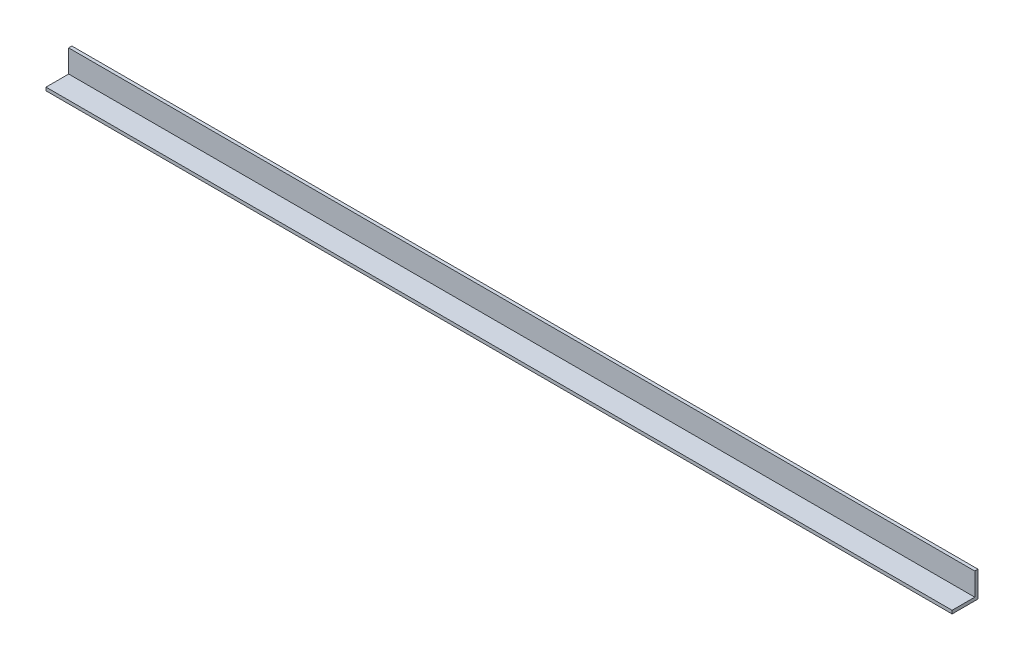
from build123d import *

# Parameters (mm, degrees)
SKETCH1_W           = 889
SKETCH1_H           = 25.4
BOSS_EXTRUDE1_DEPTH = 3.175
SKETCH2_W           = 889
SKETCH2_H           = 3.175
BOSS_EXTRUDE2_DEPTH = 22.225


with BuildPart() as part:
    # Sketch1 → Boss-Extrude1 (new body)
    with BuildSketch(Plane(origin=(0, 0, 0), x_dir=(1, 0, 0), z_dir=(0, 1, 0))):
        Rectangle(SKETCH1_W, SKETCH1_H)
    extrude(amount=BOSS_EXTRUDE1_DEPTH)

    # Sketch2 → Boss-Extrude2 (add)
    with BuildSketch(Plane(origin=(0, 3.175, 0), x_dir=(1, 0, 0), z_dir=(0, 1, 0))):
        with Locations((0, 11.1125)):
            Rectangle(SKETCH2_W, SKETCH2_H)
    extrude(amount=BOSS_EXTRUDE2_DEPTH)


solid = part.part
